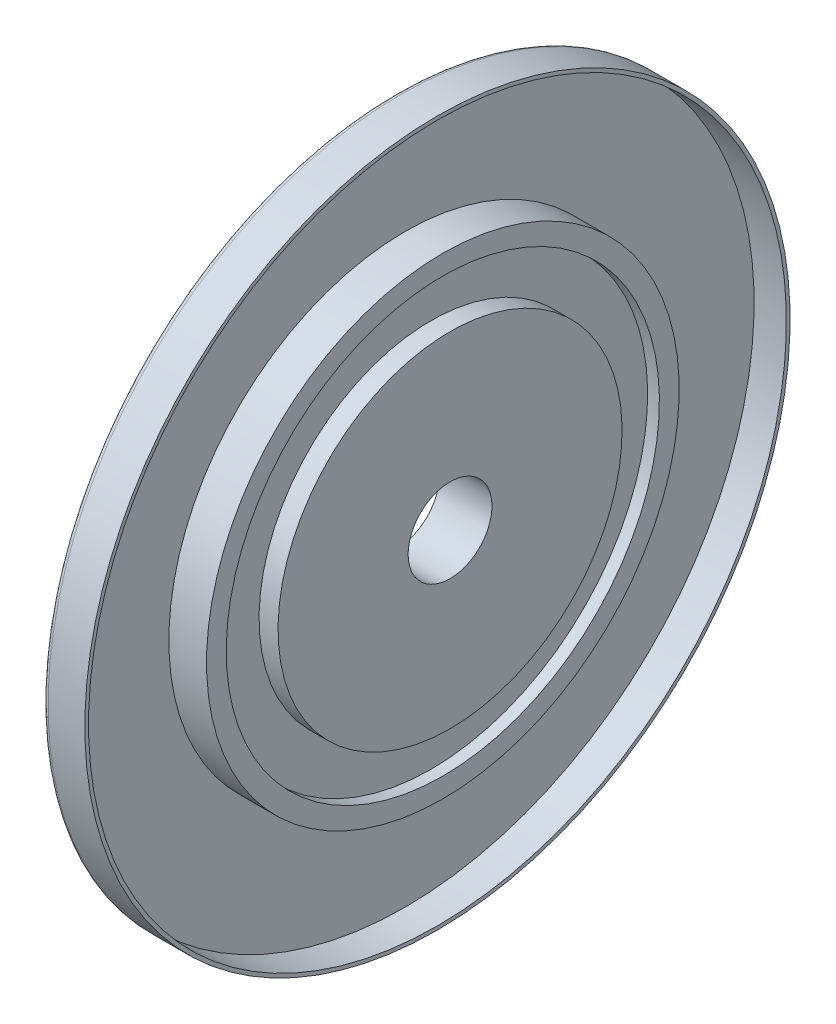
from build123d import *


with BuildPart() as part:
    # Sketch2 → Revolve1 (revolve)
    with BuildSketch(Plane.XY, mode=Mode.PRIVATE) as revolve1_sk:
        with BuildLine():
            Line((-4.1656, 26.67), (-5.9944, 26.67))
            Line((-5.9944, 26.67), (-5.9944, 33.5788))
            Line((-5.9944, 33.5788), (-4.1656, 33.5788))
            Line((-4.1656, 33.5788), (-4.1656, 36.6395))
            Line((-4.1656, 36.6395), (-10.0076, 36.6395))
            Line((-10.0076, 36.6395), (-10.0076, 54.102))
            Line((-10.0076, 54.102), (-5, 54.102))
            Line((-5, 54.102), (-5, 54.668692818))
            Line((-5, 54.668692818), (-10.70625, 54.668692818))
            ThreePointArc((-10.70625, 54.668692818), (-11.267516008, 54.436208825), (-11.5, 53.874942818))
            Line((-11.5, 53.874942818), (-11.5, 18.82775))
            ThreePointArc((-11.5, 18.82775), (-11.267516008, 18.266483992), (-10.70625, 18.034))
            Line((-10.70625, 18.034), (-4.699, 18.034))
            Line((-4.699, 18.034), (-4.699, 12.7))
            Line((-4.699, 12.7), (-7.06755, 12.7))
            Line((-7.06755, 12.7), (-11.2061, 6.5))
            Line((-11.2061, 6.5), (-4.699, 6.5))
            Line((-4.699, 6.5), (-3.048, 6.5))
            Line((-3.048, 6.5), (-3.048, 26.67))
            Line((-3.048, 26.67), (-4.1656, 26.67))
        make_face()
    revolve(revolve1_sk.sketch.rotate(Axis((0, 0, 0), (1, 0, 0)), 180), axis=Axis((0, 0, 0), (1, 0, 0)))


solid = part.part
